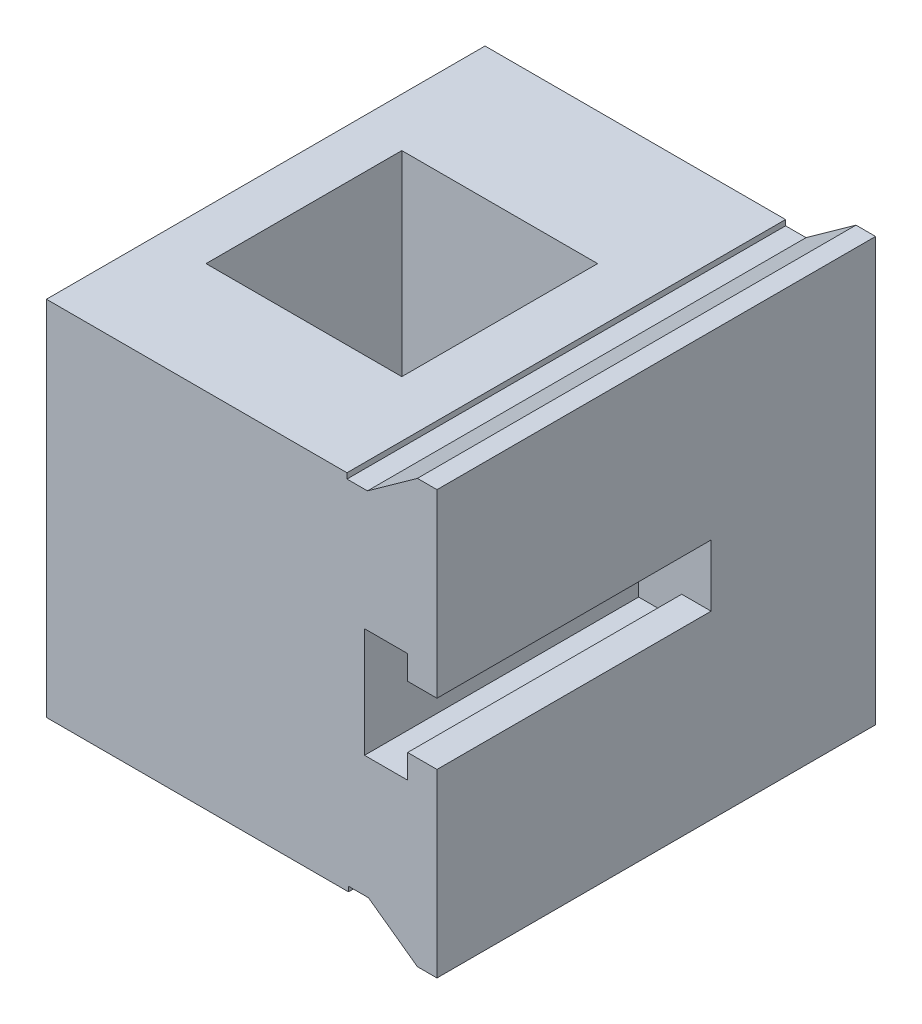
ISO-10303-21;
HEADER;
FILE_DESCRIPTION(('STEP AP214'),'2;1');
FILE_NAME('part.step','',(''),(''),'','','');
FILE_SCHEMA(('AUTOMOTIVE_DESIGN { 1 0 10303 214 1 1 1 1 }'));
ENDSEC;
DATA;
#1=APPLICATION_CONTEXT('core data for automotive mechanical design processes');
#2=APPLICATION_PROTOCOL_DEFINITION('international standard','automotive_design',2000,#1);
#3=PRODUCT_CONTEXT('',#1,'mechanical');
#4=PRODUCT('Part','Part','',(#3));
#5=PRODUCT_RELATED_PRODUCT_CATEGORY('part','',(#4));
#6=PRODUCT_DEFINITION_FORMATION('','',#4);
#7=PRODUCT_DEFINITION_CONTEXT('part definition',#1,'design');
#8=PRODUCT_DEFINITION('design','',#6,#7);
#9=PRODUCT_DEFINITION_SHAPE('','',#8);
#10=(LENGTH_UNIT() NAMED_UNIT(*) SI_UNIT(.MILLI.,.METRE.));
#11=(NAMED_UNIT(*) PLANE_ANGLE_UNIT() SI_UNIT($,.RADIAN.));
#12=(NAMED_UNIT(*) SI_UNIT($,.STERADIAN.) SOLID_ANGLE_UNIT());
#13=UNCERTAINTY_MEASURE_WITH_UNIT(LENGTH_MEASURE(1.E-05),#10,'distance_accuracy_value','');
#14=(GEOMETRIC_REPRESENTATION_CONTEXT(3) GLOBAL_UNCERTAINTY_ASSIGNED_CONTEXT((#13)) GLOBAL_UNIT_ASSIGNED_CONTEXT((#10,
#11,#12)) REPRESENTATION_CONTEXT('',''));
#15=CARTESIAN_POINT('',(0.,0.,0.));
#16=DIRECTION('',(0.,0.,1.));
#17=DIRECTION('',(1.,0.,0.));
#18=AXIS2_PLACEMENT_3D('',#15,#16,#17);
#19=CARTESIAN_POINT('',(-20.989332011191,2.24372854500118,0.));
#20=DIRECTION('',(-1.,0.,0.));
#21=DIRECTION('',(0.,0.,1.));
#22=AXIS2_PLACEMENT_3D('',#19,#20,#21);
#23=CYLINDRICAL_SURFACE('',#22,3.);
#24=CARTESIAN_POINT('',(-25.989332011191,2.24372854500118,0.));
#25=DIRECTION('',(-1.,0.,0.));
#26=DIRECTION('',(0.,0.,1.));
#27=AXIS2_PLACEMENT_3D('',#24,#25,#26);
#28=CIRCLE('',#27,3.);
#29=CARTESIAN_POINT('',(-25.989332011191,2.24372854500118,3.));
#30=VERTEX_POINT('',#29);
#31=EDGE_CURVE('E269',#30,#30,#28,.T.);
#32=ORIENTED_EDGE('',*,*,#31,.F.);
#33=EDGE_LOOP('',(#32));
#34=FACE_BOUND('',#33,.T.);
#35=CARTESIAN_POINT('',(-28.989332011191,2.24372854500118,0.));
#36=DIRECTION('',(-1.,0.,0.));
#37=DIRECTION('',(0.,0.,1.));
#38=AXIS2_PLACEMENT_3D('',#35,#36,#37);
#39=CIRCLE('',#38,3.);
#40=CARTESIAN_POINT('',(-28.989332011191,2.24372854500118,3.));
#41=VERTEX_POINT('',#40);
#42=EDGE_CURVE('E51',#41,#41,#39,.F.);
#43=ORIENTED_EDGE('',*,*,#42,.F.);
#44=EDGE_LOOP('',(#43));
#45=FACE_BOUND('',#44,.T.);
#46=ADVANCED_FACE('F47',(#34,#45),#23,.F.);
#47=CARTESIAN_POINT('',(-1.16941230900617E-13,-16.7583056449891,-23.));
#48=DIRECTION('',(0.,1.,0.));
#49=DIRECTION('',(-1.,0.,0.));
#50=AXIS2_PLACEMENT_3D('',#47,#48,#49);
#51=PLANE('',#50);
#52=DIRECTION('',(-1.,0.,0.));
#53=VECTOR('',#52,1.);
#54=CARTESIAN_POINT('',(-1.16941230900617E-13,-16.7583056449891,-9.5));
#55=LINE('',#54,#53);
#56=CARTESIAN_POINT('',(-5.98933201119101,-16.758305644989,-9.5));
#57=VERTEX_POINT('',#56);
#58=CARTESIAN_POINT('',(-25.989332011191,-16.7583056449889,-9.5));
#59=VERTEX_POINT('',#58);
#60=EDGE_CURVE('E277',#57,#59,#55,.T.);
#61=ORIENTED_EDGE('',*,*,#60,.T.);
#62=DIRECTION('',(0.,0.,1.));
#63=VECTOR('',#62,1.);
#64=CARTESIAN_POINT('',(-25.989332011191,-16.7583056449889,-23.));
#65=LINE('',#64,#63);
#66=CARTESIAN_POINT('',(-25.989332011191,-16.7583056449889,10.5));
#67=VERTEX_POINT('',#66);
#68=EDGE_CURVE('E281',#59,#67,#65,.T.);
#69=ORIENTED_EDGE('',*,*,#68,.T.);
#70=DIRECTION('',(1.,0.,0.));
#71=VECTOR('',#70,1.);
#72=CARTESIAN_POINT('',(-1.16941230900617E-13,-16.7583056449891,10.5));
#73=LINE('',#72,#71);
#74=CARTESIAN_POINT('',(-5.989332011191,-16.758305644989,10.5));
#75=VERTEX_POINT('',#74);
#76=EDGE_CURVE('E259',#67,#75,#73,.T.);
#77=ORIENTED_EDGE('',*,*,#76,.T.);
#78=DIRECTION('',(0.,0.,-1.));
#79=VECTOR('',#78,1.);
#80=CARTESIAN_POINT('',(-5.98933201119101,-16.758305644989,-23.));
#81=LINE('',#80,#79);
#82=EDGE_CURVE('E273',#75,#57,#81,.T.);
#83=ORIENTED_EDGE('',*,*,#82,.T.);
#84=EDGE_LOOP('',(#61,#69,#77,#83));
#85=FACE_BOUND('',#84,.T.);
#86=DIRECTION('',(0.,0.,1.));
#87=VECTOR('',#86,1.);
#88=CARTESIAN_POINT('',(-0.135433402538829,-16.758305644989,-23.));
#89=LINE('',#88,#87);
#90=CARTESIAN_POINT('',(-0.135433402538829,-16.758305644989,-23.));
#91=VERTEX_POINT('',#90);
#92=CARTESIAN_POINT('',(-0.135433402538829,-16.758305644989,21.8));
#93=VERTEX_POINT('',#92);
#94=EDGE_CURVE('E366',#91,#93,#89,.T.);
#95=ORIENTED_EDGE('',*,*,#94,.T.);
#96=DIRECTION('',(-1.,0.,0.));
#97=VECTOR('',#96,1.);
#98=CARTESIAN_POINT('',(-1.16941230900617E-13,-16.7583056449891,21.8));
#99=LINE('',#98,#97);
#100=CARTESIAN_POINT('',(-30.989332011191,-16.7583056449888,21.8));
#101=VERTEX_POINT('',#100);
#102=EDGE_CURVE('E285',#93,#101,#99,.T.);
#103=ORIENTED_EDGE('',*,*,#102,.T.);
#104=DIRECTION('',(0.,0.,1.));
#105=VECTOR('',#104,1.);
#106=CARTESIAN_POINT('',(-30.989332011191,-16.7583056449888,-23.));
#107=LINE('',#106,#105);
#108=CARTESIAN_POINT('',(-30.989332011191,-16.7583056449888,-23.));
#109=VERTEX_POINT('',#108);
#110=EDGE_CURVE('E367',#109,#101,#107,.T.);
#111=ORIENTED_EDGE('',*,*,#110,.F.);
#112=DIRECTION('',(-1.,0.,0.));
#113=VECTOR('',#112,1.);
#114=CARTESIAN_POINT('',(-1.16941230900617E-13,-16.7583056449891,-23.));
#115=LINE('',#114,#113);
#116=EDGE_CURVE('E329',#91,#109,#115,.T.);
#117=ORIENTED_EDGE('',*,*,#116,.F.);
#118=EDGE_LOOP('',(#95,#103,#111,#117));
#119=FACE_BOUND('',#118,.T.);
#120=ADVANCED_FACE('F49',(#85,#119),#51,.F.);
#121=CARTESIAN_POINT('',(-30.989332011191,0.,-23.));
#122=DIRECTION('',(-1.,0.,0.));
#123=DIRECTION('',(0.,0.,1.));
#124=AXIS2_PLACEMENT_3D('',#121,#122,#123);
#125=PLANE('',#124);
#126=CARTESIAN_POINT('',(-30.989332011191,2.24372854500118,0.));
#127=DIRECTION('',(-1.,0.,0.));
#128=DIRECTION('',(0.,0.,1.));
#129=AXIS2_PLACEMENT_3D('',#126,#127,#128);
#130=CIRCLE('',#129,6.5);
#131=CARTESIAN_POINT('',(-30.989332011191,2.24372854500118,6.5));
#132=VERTEX_POINT('',#131);
#133=EDGE_CURVE('E250',#132,#132,#130,.T.);
#134=ORIENTED_EDGE('',*,*,#133,.F.);
#135=EDGE_LOOP('',(#134));
#136=FACE_BOUND('',#135,.T.);
#137=ORIENTED_EDGE('',*,*,#110,.T.);
#138=DIRECTION('',(0.,-1.,0.));
#139=VECTOR('',#138,1.);
#140=CARTESIAN_POINT('',(-30.989332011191,0.,21.8));
#141=LINE('',#140,#139);
#142=CARTESIAN_POINT('',(-30.989332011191,20.241694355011,21.8));
#143=VERTEX_POINT('',#142);
#144=EDGE_CURVE('E325',#143,#101,#141,.T.);
#145=ORIENTED_EDGE('',*,*,#144,.F.);
#146=DIRECTION('',(0.,0.,1.));
#147=VECTOR('',#146,1.);
#148=CARTESIAN_POINT('',(-30.989332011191,20.241694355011,-23.));
#149=LINE('',#148,#147);
#150=CARTESIAN_POINT('',(-30.989332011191,20.241694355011,-23.));
#151=VERTEX_POINT('',#150);
#152=EDGE_CURVE('E371',#151,#143,#149,.T.);
#153=ORIENTED_EDGE('',*,*,#152,.F.);
#154=DIRECTION('',(0.,-1.,0.));
#155=VECTOR('',#154,1.);
#156=CARTESIAN_POINT('',(-30.989332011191,0.,-23.));
#157=LINE('',#156,#155);
#158=EDGE_CURVE('E362',#151,#109,#157,.T.);
#159=ORIENTED_EDGE('',*,*,#158,.T.);
#160=EDGE_LOOP('',(#137,#145,#153,#159));
#161=FACE_BOUND('',#160,.T.);
#162=ADVANCED_FACE('F426',(#136,#161),#125,.T.);
#163=CARTESIAN_POINT('',(0.,20.241694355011,-23.));
#164=DIRECTION('',(0.,1.,0.));
#165=DIRECTION('',(0.,0.,1.));
#166=AXIS2_PLACEMENT_3D('',#163,#164,#165);
#167=PLANE('',#166);
#168=DIRECTION('',(0.,0.,1.));
#169=VECTOR('',#168,1.);
#170=CARTESIAN_POINT('',(-25.989332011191,20.241694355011,-23.));
#171=LINE('',#170,#169);
#172=CARTESIAN_POINT('',(-25.989332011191,20.241694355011,-9.5));
#173=VERTEX_POINT('',#172);
#174=CARTESIAN_POINT('',(-25.989332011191,20.241694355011,10.5));
#175=VERTEX_POINT('',#174);
#176=EDGE_CURVE('E11',#173,#175,#171,.T.);
#177=ORIENTED_EDGE('',*,*,#176,.F.);
#178=DIRECTION('',(-1.,0.,0.));
#179=VECTOR('',#178,1.);
#180=CARTESIAN_POINT('',(0.,20.241694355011,-9.5));
#181=LINE('',#180,#179);
#182=CARTESIAN_POINT('',(-5.98933201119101,20.241694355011,-9.5));
#183=VERTEX_POINT('',#182);
#184=EDGE_CURVE('E57',#183,#173,#181,.T.);
#185=ORIENTED_EDGE('',*,*,#184,.F.);
#186=DIRECTION('',(0.,0.,-1.));
#187=VECTOR('',#186,1.);
#188=CARTESIAN_POINT('',(-5.98933201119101,20.241694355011,-23.));
#189=LINE('',#188,#187);
#190=CARTESIAN_POINT('',(-5.989332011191,20.241694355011,10.5));
#191=VERTEX_POINT('',#190);
#192=EDGE_CURVE('E406',#191,#183,#189,.T.);
#193=ORIENTED_EDGE('',*,*,#192,.F.);
#194=DIRECTION('',(1.,0.,0.));
#195=VECTOR('',#194,1.);
#196=CARTESIAN_POINT('',(0.,20.241694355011,10.5));
#197=LINE('',#196,#195);
#198=EDGE_CURVE('E370',#175,#191,#197,.T.);
#199=ORIENTED_EDGE('',*,*,#198,.F.);
#200=EDGE_LOOP('',(#177,#185,#193,#199));
#201=FACE_BOUND('',#200,.T.);
#202=ORIENTED_EDGE('',*,*,#152,.T.);
#203=DIRECTION('',(-1.,0.,0.));
#204=VECTOR('',#203,1.);
#205=CARTESIAN_POINT('',(0.,20.241694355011,21.8));
#206=LINE('',#205,#204);
#207=CARTESIAN_POINT('',(-0.290879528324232,20.241694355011,21.8));
#208=VERTEX_POINT('',#207);
#209=EDGE_CURVE('E321',#208,#143,#206,.T.);
#210=ORIENTED_EDGE('',*,*,#209,.F.);
#211=DIRECTION('',(0.,0.,1.));
#212=VECTOR('',#211,1.);
#213=CARTESIAN_POINT('',(-0.290879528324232,20.241694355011,-23.));
#214=LINE('',#213,#212);
#215=CARTESIAN_POINT('',(-0.290879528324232,20.241694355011,-23.));
#216=VERTEX_POINT('',#215);
#217=EDGE_CURVE('E374',#216,#208,#214,.T.);
#218=ORIENTED_EDGE('',*,*,#217,.F.);
#219=DIRECTION('',(-1.,0.,0.));
#220=VECTOR('',#219,1.);
#221=CARTESIAN_POINT('',(0.,20.241694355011,-23.));
#222=LINE('',#221,#220);
#223=EDGE_CURVE('E358',#216,#151,#222,.T.);
#224=ORIENTED_EDGE('',*,*,#223,.T.);
#225=EDGE_LOOP('',(#202,#210,#218,#224));
#226=FACE_BOUND('',#225,.T.);
#227=ADVANCED_FACE('F457',(#201,#226),#167,.T.);
#228=CARTESIAN_POINT('',(-0.205835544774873,-0.000864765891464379,-23.));
#229=DIRECTION('',(0.999991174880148,0.00420120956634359,0.));
#230=DIRECTION('',(-0.00420120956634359,0.999991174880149,0.));
#231=AXIS2_PLACEMENT_3D('',#228,#229,#230);
#232=PLANE('',#231);
#233=ORIENTED_EDGE('',*,*,#217,.T.);
#234=DIRECTION('',(-0.00420120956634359,0.999991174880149,0.));
#235=VECTOR('',#234,1.);
#236=CARTESIAN_POINT('',(-0.205835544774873,-0.000864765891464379,21.8));
#237=LINE('',#236,#235);
#238=CARTESIAN_POINT('',(-0.288534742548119,19.6835776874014,21.8));
#239=VERTEX_POINT('',#238);
#240=EDGE_CURVE('E294',#239,#208,#237,.T.);
#241=ORIENTED_EDGE('',*,*,#240,.F.);
#242=DIRECTION('',(0.,0.,1.));
#243=VECTOR('',#242,1.);
#244=CARTESIAN_POINT('',(-0.288534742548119,19.6835776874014,-23.));
#245=LINE('',#244,#243);
#246=CARTESIAN_POINT('',(-0.288534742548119,19.6835776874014,-23.));
#247=VERTEX_POINT('',#246);
#248=EDGE_CURVE('E377',#247,#239,#245,.T.);
#249=ORIENTED_EDGE('',*,*,#248,.F.);
#250=DIRECTION('',(-0.00420120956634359,0.999991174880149,0.));
#251=VECTOR('',#250,1.);
#252=CARTESIAN_POINT('',(-0.205835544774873,-0.000864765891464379,-23.));
#253=LINE('',#252,#251);
#254=EDGE_CURVE('E337',#247,#216,#253,.T.);
#255=ORIENTED_EDGE('',*,*,#254,.T.);
#256=EDGE_LOOP('',(#233,#241,#249,#255));
#257=FACE_BOUND('',#256,.T.);
#258=ADVANCED_FACE('F461',(#257),#232,.T.);
#259=CARTESIAN_POINT('',(0.,19.6835776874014,-23.));
#260=DIRECTION('',(0.,-1.,0.));
#261=DIRECTION('',(1.,0.,0.));
#262=AXIS2_PLACEMENT_3D('',#259,#260,#261);
#263=PLANE('',#262);
#264=ORIENTED_EDGE('',*,*,#248,.T.);
#265=DIRECTION('',(1.,0.,0.));
#266=VECTOR('',#265,1.);
#267=CARTESIAN_POINT('',(0.,19.6835776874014,21.8));
#268=LINE('',#267,#266);
#269=CARTESIAN_POINT('',(1.80132440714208,19.6835776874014,21.8));
#270=VERTEX_POINT('',#269);
#271=EDGE_CURVE('E317',#239,#270,#268,.T.);
#272=ORIENTED_EDGE('',*,*,#271,.T.);
#273=DIRECTION('',(0.,0.,1.));
#274=VECTOR('',#273,1.);
#275=CARTESIAN_POINT('',(1.80132440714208,19.6835776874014,-23.));
#276=LINE('',#275,#274);
#277=CARTESIAN_POINT('',(1.80132440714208,19.6835776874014,-23.));
#278=VERTEX_POINT('',#277);
#279=EDGE_CURVE('E380',#278,#270,#276,.T.);
#280=ORIENTED_EDGE('',*,*,#279,.F.);
#281=DIRECTION('',(1.,0.,0.));
#282=VECTOR('',#281,1.);
#283=CARTESIAN_POINT('',(0.,19.6835776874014,-23.));
#284=LINE('',#283,#282);
#285=EDGE_CURVE('E355',#247,#278,#284,.T.);
#286=ORIENTED_EDGE('',*,*,#285,.F.);
#287=EDGE_LOOP('',(#264,#272,#280,#286));
#288=FACE_BOUND('',#287,.T.);
#289=ADVANCED_FACE('F465',(#288),#263,.F.);
#290=CARTESIAN_POINT('',(-8.7097527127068,12.1465502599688,-23.));
#291=DIRECTION('',(0.582727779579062,-0.812667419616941,0.));
#292=DIRECTION('',(0.812667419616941,0.582727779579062,0.));
#293=AXIS2_PLACEMENT_3D('',#290,#291,#292);
#294=PLANE('',#293);
#295=ORIENTED_EDGE('',*,*,#279,.T.);
#296=DIRECTION('',(0.812667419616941,0.582727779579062,0.));
#297=VECTOR('',#296,1.);
#298=CARTESIAN_POINT('',(-8.7097527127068,12.1465502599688,21.8));
#299=LINE('',#298,#297);
#300=CARTESIAN_POINT('',(6.9029046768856,23.3416947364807,21.8));
#301=VERTEX_POINT('',#300);
#302=EDGE_CURVE('E313',#270,#301,#299,.T.);
#303=ORIENTED_EDGE('',*,*,#302,.T.);
#304=DIRECTION('',(0.,0.,1.));
#305=VECTOR('',#304,1.);
#306=CARTESIAN_POINT('',(6.9029046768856,23.3416947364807,-23.));
#307=LINE('',#306,#305);
#308=CARTESIAN_POINT('',(6.9029046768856,23.3416947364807,-23.));
#309=VERTEX_POINT('',#308);
#310=EDGE_CURVE('E383',#309,#301,#307,.T.);
#311=ORIENTED_EDGE('',*,*,#310,.F.);
#312=DIRECTION('',(0.812667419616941,0.582727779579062,0.));
#313=VECTOR('',#312,1.);
#314=CARTESIAN_POINT('',(-8.7097527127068,12.1465502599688,-23.));
#315=LINE('',#314,#313);
#316=EDGE_CURVE('E352',#278,#309,#315,.T.);
#317=ORIENTED_EDGE('',*,*,#316,.F.);
#318=EDGE_LOOP('',(#295,#303,#311,#317));
#319=FACE_BOUND('',#318,.T.);
#320=ADVANCED_FACE('F469',(#319),#294,.F.);
#321=CARTESIAN_POINT('',(0.,23.3416947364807,-23.));
#322=DIRECTION('',(0.,-1.,0.));
#323=DIRECTION('',(0.,0.,-1.));
#324=AXIS2_PLACEMENT_3D('',#321,#322,#323);
#325=PLANE('',#324);
#326=ORIENTED_EDGE('',*,*,#310,.T.);
#327=DIRECTION('',(1.,0.,0.));
#328=VECTOR('',#327,1.);
#329=CARTESIAN_POINT('',(0.,23.3416947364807,21.8));
#330=LINE('',#329,#328);
#331=CARTESIAN_POINT('',(8.90290515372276,23.3416947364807,21.8));
#332=VERTEX_POINT('',#331);
#333=EDGE_CURVE('E309',#301,#332,#330,.T.);
#334=ORIENTED_EDGE('',*,*,#333,.T.);
#335=DIRECTION('',(0.,0.,1.));
#336=VECTOR('',#335,1.);
#337=CARTESIAN_POINT('',(8.90290515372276,23.3416947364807,-23.));
#338=LINE('',#337,#336);
#339=CARTESIAN_POINT('',(8.90290515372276,23.3416947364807,-23.));
#340=VERTEX_POINT('',#339);
#341=EDGE_CURVE('E386',#340,#332,#338,.T.);
#342=ORIENTED_EDGE('',*,*,#341,.F.);
#343=DIRECTION('',(1.,0.,0.));
#344=VECTOR('',#343,1.);
#345=CARTESIAN_POINT('',(0.,23.3416947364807,-23.));
#346=LINE('',#345,#344);
#347=EDGE_CURVE('E349',#309,#340,#346,.T.);
#348=ORIENTED_EDGE('',*,*,#347,.F.);
#349=EDGE_LOOP('',(#326,#334,#342,#348));
#350=FACE_BOUND('',#349,.T.);
#351=ADVANCED_FACE('F473',(#350),#325,.F.);
#352=CARTESIAN_POINT('',(8.90290515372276,0.,-23.));
#353=DIRECTION('',(-1.,0.,0.));
#354=DIRECTION('',(0.,0.,1.));
#355=AXIS2_PLACEMENT_3D('',#352,#353,#354);
#356=PLANE('',#355);
#357=DIRECTION('',(0.,1.,0.));
#358=VECTOR('',#357,1.);
#359=CARTESIAN_POINT('',(8.90290515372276,4.89169435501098,-6.2));
#360=LINE('',#359,#358);
#361=CARTESIAN_POINT('',(8.90290515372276,-1.40830564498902,-6.2));
#362=VERTEX_POINT('',#361);
#363=CARTESIAN_POINT('',(8.90290515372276,4.89169435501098,-6.2));
#364=VERTEX_POINT('',#363);
#365=EDGE_CURVE('E219',#362,#364,#360,.T.);
#366=ORIENTED_EDGE('',*,*,#365,.F.);
#367=DIRECTION('',(0.,0.,1.));
#368=VECTOR('',#367,1.);
#369=CARTESIAN_POINT('',(8.90290515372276,-1.40830564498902,-6.2));
#370=LINE('',#369,#368);
#371=CARTESIAN_POINT('',(8.90290515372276,-1.40830564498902,21.8));
#372=VERTEX_POINT('',#371);
#373=EDGE_CURVE('E254',#362,#372,#370,.T.);
#374=ORIENTED_EDGE('',*,*,#373,.T.);
#375=DIRECTION('',(0.,-1.,0.));
#376=VECTOR('',#375,1.);
#377=CARTESIAN_POINT('',(8.90290515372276,0.,21.8));
#378=LINE('',#377,#376);
#379=CARTESIAN_POINT('',(8.90290515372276,-19.8583060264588,21.8));
#380=VERTEX_POINT('',#379);
#381=EDGE_CURVE('E306',#372,#380,#378,.T.);
#382=ORIENTED_EDGE('',*,*,#381,.T.);
#383=DIRECTION('',(0.,0.,1.));
#384=VECTOR('',#383,1.);
#385=CARTESIAN_POINT('',(8.90290515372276,-19.8583060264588,-23.));
#386=LINE('',#385,#384);
#387=CARTESIAN_POINT('',(8.90290515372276,-19.8583060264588,-23.));
#388=VERTEX_POINT('',#387);
#389=EDGE_CURVE('E389',#388,#380,#386,.T.);
#390=ORIENTED_EDGE('',*,*,#389,.F.);
#391=DIRECTION('',(0.,-1.,0.));
#392=VECTOR('',#391,1.);
#393=CARTESIAN_POINT('',(8.90290515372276,0.,-23.));
#394=LINE('',#393,#392);
#395=EDGE_CURVE('E346',#340,#388,#394,.T.);
#396=ORIENTED_EDGE('',*,*,#395,.F.);
#397=ORIENTED_EDGE('',*,*,#341,.T.);
#398=CARTESIAN_POINT('',(8.90290515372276,4.89169435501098,21.8));
#399=VERTEX_POINT('',#398);
#400=EDGE_CURVE('E235',#332,#399,#378,.T.);
#401=ORIENTED_EDGE('',*,*,#400,.T.);
#402=DIRECTION('',(0.,0.,1.));
#403=VECTOR('',#402,1.);
#404=CARTESIAN_POINT('',(8.90290515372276,4.89169435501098,-6.2));
#405=LINE('',#404,#403);
#406=EDGE_CURVE('E65',#364,#399,#405,.T.);
#407=ORIENTED_EDGE('',*,*,#406,.F.);
#408=EDGE_LOOP('',(#366,#374,#382,#390,#396,#397,#401,#407));
#409=FACE_BOUND('',#408,.T.);
#410=ADVANCED_FACE('F233',(#409),#356,.F.);
#411=CARTESIAN_POINT('',(0.,-19.8583060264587,-23.));
#412=DIRECTION('',(0.,1.,0.));
#413=DIRECTION('',(-1.,0.,0.));
#414=AXIS2_PLACEMENT_3D('',#411,#412,#413);
#415=PLANE('',#414);
#416=ORIENTED_EDGE('',*,*,#389,.T.);
#417=DIRECTION('',(-1.,0.,0.));
#418=VECTOR('',#417,1.);
#419=CARTESIAN_POINT('',(0.,-19.8583060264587,21.8));
#420=LINE('',#419,#418);
#421=CARTESIAN_POINT('',(6.9029046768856,-19.8583060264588,21.8));
#422=VERTEX_POINT('',#421);
#423=EDGE_CURVE('E302',#380,#422,#420,.T.);
#424=ORIENTED_EDGE('',*,*,#423,.T.);
#425=DIRECTION('',(0.,0.,1.));
#426=VECTOR('',#425,1.);
#427=CARTESIAN_POINT('',(6.9029046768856,-19.8583060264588,-23.));
#428=LINE('',#427,#426);
#429=CARTESIAN_POINT('',(6.9029046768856,-19.8583060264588,-23.));
#430=VERTEX_POINT('',#429);
#431=EDGE_CURVE('E393',#430,#422,#428,.T.);
#432=ORIENTED_EDGE('',*,*,#431,.F.);
#433=DIRECTION('',(-1.,0.,0.));
#434=VECTOR('',#433,1.);
#435=CARTESIAN_POINT('',(0.,-19.8583060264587,-23.));
#436=LINE('',#435,#434);
#437=EDGE_CURVE('E343',#388,#430,#436,.T.);
#438=ORIENTED_EDGE('',*,*,#437,.F.);
#439=EDGE_LOOP('',(#416,#424,#432,#438));
#440=FACE_BOUND('',#439,.T.);
#441=ADVANCED_FACE('F480',(#440),#415,.F.);
#442=CARTESIAN_POINT('',(-7.05974351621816,-9.80519935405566,-23.));
#443=DIRECTION('',(0.584304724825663,0.811534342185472,0.));
#444=DIRECTION('',(-0.811534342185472,0.584304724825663,0.));
#445=AXIS2_PLACEMENT_3D('',#442,#443,#444);
#446=PLANE('',#445);
#447=ORIENTED_EDGE('',*,*,#431,.T.);
#448=DIRECTION('',(-0.811534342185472,0.584304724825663,0.));
#449=VECTOR('',#448,1.);
#450=CARTESIAN_POINT('',(-7.05974351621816,-9.80519935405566,21.8));
#451=LINE('',#450,#449);
#452=CARTESIAN_POINT('',(1.90290479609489,-16.2583061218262,21.8));
#453=VERTEX_POINT('',#452);
#454=EDGE_CURVE('E298',#422,#453,#451,.T.);
#455=ORIENTED_EDGE('',*,*,#454,.T.);
#456=DIRECTION('',(0.,0.,1.));
#457=VECTOR('',#456,1.);
#458=CARTESIAN_POINT('',(1.90290479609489,-16.2583061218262,-23.));
#459=LINE('',#458,#457);
#460=CARTESIAN_POINT('',(1.90290479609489,-16.2583061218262,-23.));
#461=VERTEX_POINT('',#460);
#462=EDGE_CURVE('E396',#461,#453,#459,.T.);
#463=ORIENTED_EDGE('',*,*,#462,.F.);
#464=DIRECTION('',(-0.811534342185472,0.584304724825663,0.));
#465=VECTOR('',#464,1.);
#466=CARTESIAN_POINT('',(-7.05974351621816,-9.80519935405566,-23.));
#467=LINE('',#466,#465);
#468=EDGE_CURVE('E340',#430,#461,#467,.T.);
#469=ORIENTED_EDGE('',*,*,#468,.F.);
#470=EDGE_LOOP('',(#447,#455,#463,#469));
#471=FACE_BOUND('',#470,.T.);
#472=ADVANCED_FACE('F483',(#471),#446,.F.);
#473=CARTESIAN_POINT('',(0.,-16.2583061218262,-23.));
#474=DIRECTION('',(0.,1.,0.));
#475=DIRECTION('',(0.,0.,1.));
#476=AXIS2_PLACEMENT_3D('',#473,#474,#475);
#477=PLANE('',#476);
#478=ORIENTED_EDGE('',*,*,#462,.T.);
#479=DIRECTION('',(-1.,0.,0.));
#480=VECTOR('',#479,1.);
#481=CARTESIAN_POINT('',(0.,-16.2583061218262,21.8));
#482=LINE('',#481,#480);
#483=CARTESIAN_POINT('',(-0.137534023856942,-16.2583061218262,21.8));
#484=VERTEX_POINT('',#483);
#485=EDGE_CURVE('E293',#453,#484,#482,.T.);
#486=ORIENTED_EDGE('',*,*,#485,.T.);
#487=DIRECTION('',(0.,0.,1.));
#488=VECTOR('',#487,1.);
#489=CARTESIAN_POINT('',(-0.137534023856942,-16.2583061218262,-23.));
#490=LINE('',#489,#488);
#491=CARTESIAN_POINT('',(-0.137534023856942,-16.2583061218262,-23.));
#492=VERTEX_POINT('',#491);
#493=EDGE_CURVE('E399',#492,#484,#490,.T.);
#494=ORIENTED_EDGE('',*,*,#493,.F.);
#495=DIRECTION('',(-1.,0.,0.));
#496=VECTOR('',#495,1.);
#497=CARTESIAN_POINT('',(0.,-16.2583061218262,-23.));
#498=LINE('',#497,#496);
#499=EDGE_CURVE('E336',#461,#492,#498,.T.);
#500=ORIENTED_EDGE('',*,*,#499,.F.);
#501=EDGE_LOOP('',(#478,#486,#494,#500));
#502=FACE_BOUND('',#501,.T.);
#503=ADVANCED_FACE('F486',(#502),#477,.F.);
#504=ORIENTED_EDGE('',*,*,#493,.T.);
#505=EDGE_CURVE('E289',#93,#484,#237,.T.);
#506=ORIENTED_EDGE('',*,*,#505,.F.);
#507=ORIENTED_EDGE('',*,*,#94,.F.);
#508=EDGE_CURVE('E332',#91,#492,#253,.T.);
#509=ORIENTED_EDGE('',*,*,#508,.T.);
#510=EDGE_LOOP('',(#504,#506,#507,#509));
#511=FACE_BOUND('',#510,.T.);
#512=ADVANCED_FACE('F453',(#511),#232,.T.);
#513=CARTESIAN_POINT('',(0.,0.,-23.));
#514=DIRECTION('',(0.,0.,1.));
#515=DIRECTION('',(1.,0.,0.));
#516=AXIS2_PLACEMENT_3D('',#513,#514,#515);
#517=PLANE('',#516);
#518=ORIENTED_EDGE('',*,*,#116,.T.);
#519=ORIENTED_EDGE('',*,*,#158,.F.);
#520=ORIENTED_EDGE('',*,*,#223,.F.);
#521=ORIENTED_EDGE('',*,*,#254,.F.);
#522=ORIENTED_EDGE('',*,*,#285,.T.);
#523=ORIENTED_EDGE('',*,*,#316,.T.);
#524=ORIENTED_EDGE('',*,*,#347,.T.);
#525=ORIENTED_EDGE('',*,*,#395,.T.);
#526=ORIENTED_EDGE('',*,*,#437,.T.);
#527=ORIENTED_EDGE('',*,*,#468,.T.);
#528=ORIENTED_EDGE('',*,*,#499,.T.);
#529=ORIENTED_EDGE('',*,*,#508,.F.);
#530=EDGE_LOOP('',(#518,#519,#520,#521,#522,#523,#524,#525,#526,#527,#528,#529));
#531=FACE_BOUND('',#530,.T.);
#532=ADVANCED_FACE('F449',(#531),#517,.F.);
#533=CARTESIAN_POINT('',(0.,0.,21.8));
#534=DIRECTION('',(0.,0.,1.));
#535=DIRECTION('',(1.,0.,0.));
#536=AXIS2_PLACEMENT_3D('',#533,#534,#535);
#537=PLANE('',#536);
#538=DIRECTION('',(1.,0.,0.));
#539=VECTOR('',#538,1.);
#540=CARTESIAN_POINT('',(8.90290515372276,-1.40830564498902,21.8));
#541=LINE('',#540,#539);
#542=CARTESIAN_POINT('',(5.90290515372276,-1.40830564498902,21.8));
#543=VERTEX_POINT('',#542);
#544=EDGE_CURVE('E230',#543,#372,#541,.T.);
#545=ORIENTED_EDGE('',*,*,#544,.F.);
#546=DIRECTION('',(0.,1.,0.));
#547=VECTOR('',#546,1.);
#548=CARTESIAN_POINT('',(5.90290515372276,-1.40830564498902,21.8));
#549=LINE('',#548,#547);
#550=CARTESIAN_POINT('',(5.90290515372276,-3.85830564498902,21.8));
#551=VERTEX_POINT('',#550);
#552=EDGE_CURVE('E559',#551,#543,#549,.T.);
#553=ORIENTED_EDGE('',*,*,#552,.F.);
#554=DIRECTION('',(1.,0.,0.));
#555=VECTOR('',#554,1.);
#556=CARTESIAN_POINT('',(5.90290515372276,-3.85830564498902,21.8));
#557=LINE('',#556,#555);
#558=CARTESIAN_POINT('',(1.50290515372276,-3.85830564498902,21.8));
#559=VERTEX_POINT('',#558);
#560=EDGE_CURVE('E555',#559,#551,#557,.T.);
#561=ORIENTED_EDGE('',*,*,#560,.F.);
#562=DIRECTION('',(0.,-1.,0.));
#563=VECTOR('',#562,1.);
#564=CARTESIAN_POINT('',(1.50290515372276,-3.85830564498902,21.8));
#565=LINE('',#564,#563);
#566=CARTESIAN_POINT('',(1.50290515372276,7.34169435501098,21.8));
#567=VERTEX_POINT('',#566);
#568=EDGE_CURVE('E551',#567,#559,#565,.T.);
#569=ORIENTED_EDGE('',*,*,#568,.F.);
#570=DIRECTION('',(-1.,0.,0.));
#571=VECTOR('',#570,1.);
#572=CARTESIAN_POINT('',(1.50290515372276,7.34169435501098,21.8));
#573=LINE('',#572,#571);
#574=CARTESIAN_POINT('',(5.90290515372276,7.34169435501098,21.8));
#575=VERTEX_POINT('',#574);
#576=EDGE_CURVE('E544',#575,#567,#573,.T.);
#577=ORIENTED_EDGE('',*,*,#576,.F.);
#578=DIRECTION('',(0.,1.,0.));
#579=VECTOR('',#578,1.);
#580=CARTESIAN_POINT('',(5.90290515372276,7.34169435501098,21.8));
#581=LINE('',#580,#579);
#582=CARTESIAN_POINT('',(5.90290515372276,4.89169435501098,21.8));
#583=VERTEX_POINT('',#582);
#584=EDGE_CURVE('E540',#583,#575,#581,.T.);
#585=ORIENTED_EDGE('',*,*,#584,.F.);
#586=DIRECTION('',(-1.,0.,0.));
#587=VECTOR('',#586,1.);
#588=CARTESIAN_POINT('',(5.90290515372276,4.89169435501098,21.8));
#589=LINE('',#588,#587);
#590=EDGE_CURVE('E535',#399,#583,#589,.T.);
#591=ORIENTED_EDGE('',*,*,#590,.F.);
#592=ORIENTED_EDGE('',*,*,#400,.F.);
#593=ORIENTED_EDGE('',*,*,#333,.F.);
#594=ORIENTED_EDGE('',*,*,#302,.F.);
#595=ORIENTED_EDGE('',*,*,#271,.F.);
#596=ORIENTED_EDGE('',*,*,#240,.T.);
#597=ORIENTED_EDGE('',*,*,#209,.T.);
#598=ORIENTED_EDGE('',*,*,#144,.T.);
#599=ORIENTED_EDGE('',*,*,#102,.F.);
#600=ORIENTED_EDGE('',*,*,#505,.T.);
#601=ORIENTED_EDGE('',*,*,#485,.F.);
#602=ORIENTED_EDGE('',*,*,#454,.F.);
#603=ORIENTED_EDGE('',*,*,#423,.F.);
#604=ORIENTED_EDGE('',*,*,#381,.F.);
#605=EDGE_LOOP('',(#545,#553,#561,#569,#577,#585,#591,#592,#593,#594,#595,#596,#597,#598,#599,
#600,#601,#602,#603,#604));
#606=FACE_BOUND('',#605,.T.);
#607=ADVANCED_FACE('F446',(#606),#537,.T.);
#608=CARTESIAN_POINT('',(-25.989332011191,-19.8583060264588,-9.5));
#609=DIRECTION('',(-1.,0.,0.));
#610=DIRECTION('',(0.,0.,1.));
#611=AXIS2_PLACEMENT_3D('',#608,#609,#610);
#612=PLANE('',#611);
#613=ORIENTED_EDGE('',*,*,#31,.T.);
#614=EDGE_LOOP('',(#613));
#615=FACE_BOUND('',#614,.T.);
#616=DIRECTION('',(0.,1.,0.));
#617=VECTOR('',#616,1.);
#618=CARTESIAN_POINT('',(-25.989332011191,-19.8583060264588,-9.5));
#619=LINE('',#618,#617);
#620=EDGE_CURVE('E255',#59,#173,#619,.T.);
#621=ORIENTED_EDGE('',*,*,#620,.T.);
#622=ORIENTED_EDGE('',*,*,#176,.T.);
#623=DIRECTION('',(0.,1.,0.));
#624=VECTOR('',#623,1.);
#625=CARTESIAN_POINT('',(-25.989332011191,-19.8583060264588,10.5));
#626=LINE('',#625,#624);
#627=EDGE_CURVE('E266',#67,#175,#626,.T.);
#628=ORIENTED_EDGE('',*,*,#627,.F.);
#629=ORIENTED_EDGE('',*,*,#68,.F.);
#630=EDGE_LOOP('',(#621,#622,#628,#629));
#631=FACE_BOUND('',#630,.T.);
#632=ADVANCED_FACE('F436',(#615,#631),#612,.F.);
#633=CARTESIAN_POINT('',(-25.989332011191,-19.8583060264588,-9.5));
#634=DIRECTION('',(0.,0.,-1.));
#635=DIRECTION('',(-1.,0.,0.));
#636=AXIS2_PLACEMENT_3D('',#633,#634,#635);
#637=PLANE('',#636);
#638=DIRECTION('',(0.,1.,0.));
#639=VECTOR('',#638,1.);
#640=CARTESIAN_POINT('',(-5.98933201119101,-19.8583060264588,-9.5));
#641=LINE('',#640,#639);
#642=EDGE_CURVE('E260',#57,#183,#641,.T.);
#643=ORIENTED_EDGE('',*,*,#642,.T.);
#644=ORIENTED_EDGE('',*,*,#184,.T.);
#645=ORIENTED_EDGE('',*,*,#620,.F.);
#646=ORIENTED_EDGE('',*,*,#60,.F.);
#647=EDGE_LOOP('',(#643,#644,#645,#646));
#648=FACE_BOUND('',#647,.T.);
#649=ADVANCED_FACE('F432',(#648),#637,.F.);
#650=CARTESIAN_POINT('',(-5.98933201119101,-19.8583060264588,-9.5));
#651=DIRECTION('',(1.,0.,0.));
#652=DIRECTION('',(0.,0.,-1.));
#653=AXIS2_PLACEMENT_3D('',#650,#651,#652);
#654=PLANE('',#653);
#655=DIRECTION('',(0.,1.,0.));
#656=VECTOR('',#655,1.);
#657=CARTESIAN_POINT('',(-5.989332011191,-19.8583060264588,10.5));
#658=LINE('',#657,#656);
#659=EDGE_CURVE('E73',#75,#191,#658,.T.);
#660=ORIENTED_EDGE('',*,*,#659,.T.);
#661=ORIENTED_EDGE('',*,*,#192,.T.);
#662=ORIENTED_EDGE('',*,*,#642,.F.);
#663=ORIENTED_EDGE('',*,*,#82,.F.);
#664=EDGE_LOOP('',(#660,#661,#662,#663));
#665=FACE_BOUND('',#664,.T.);
#666=ADVANCED_FACE('F435',(#665),#654,.F.);
#667=CARTESIAN_POINT('',(-25.989332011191,-19.8583060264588,10.5));
#668=DIRECTION('',(0.,0.,1.));
#669=DIRECTION('',(1.,0.,0.));
#670=AXIS2_PLACEMENT_3D('',#667,#668,#669);
#671=PLANE('',#670);
#672=ORIENTED_EDGE('',*,*,#627,.T.);
#673=ORIENTED_EDGE('',*,*,#198,.T.);
#674=ORIENTED_EDGE('',*,*,#659,.F.);
#675=ORIENTED_EDGE('',*,*,#76,.F.);
#676=EDGE_LOOP('',(#672,#673,#674,#675));
#677=FACE_BOUND('',#676,.T.);
#678=ADVANCED_FACE('F440',(#677),#671,.F.);
#679=CARTESIAN_POINT('',(-28.989332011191,2.24372854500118,0.));
#680=DIRECTION('',(-1.,0.,0.));
#681=DIRECTION('',(0.,0.,1.));
#682=AXIS2_PLACEMENT_3D('',#679,#680,#681);
#683=PLANE('',#682);
#684=CARTESIAN_POINT('',(-28.989332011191,2.24372854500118,0.));
#685=DIRECTION('',(-1.,0.,0.));
#686=DIRECTION('',(0.,0.,1.));
#687=AXIS2_PLACEMENT_3D('',#684,#685,#686);
#688=CIRCLE('',#687,6.5);
#689=CARTESIAN_POINT('',(-28.989332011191,2.24372854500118,6.5));
#690=VERTEX_POINT('',#689);
#691=EDGE_CURVE('E246',#690,#690,#688,.T.);
#692=ORIENTED_EDGE('',*,*,#691,.T.);
#693=EDGE_LOOP('',(#692));
#694=FACE_BOUND('',#693,.T.);
#695=ORIENTED_EDGE('',*,*,#42,.T.);
#696=EDGE_LOOP('',(#695));
#697=FACE_BOUND('',#696,.T.);
#698=ADVANCED_FACE('F418',(#694,#697),#683,.T.);
#699=CARTESIAN_POINT('',(-28.989332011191,2.24372854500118,0.));
#700=DIRECTION('',(-1.,0.,0.));
#701=DIRECTION('',(0.,0.,1.));
#702=AXIS2_PLACEMENT_3D('',#699,#700,#701);
#703=CYLINDRICAL_SURFACE('',#702,6.5);
#704=ORIENTED_EDGE('',*,*,#691,.F.);
#705=EDGE_LOOP('',(#704));
#706=FACE_BOUND('',#705,.T.);
#707=ORIENTED_EDGE('',*,*,#133,.T.);
#708=EDGE_LOOP('',(#707));
#709=FACE_BOUND('',#708,.T.);
#710=ADVANCED_FACE('F430',(#706,#709),#703,.F.);
#711=CARTESIAN_POINT('',(8.90290515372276,-1.40830564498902,-6.2));
#712=DIRECTION('',(0.,-1.,0.));
#713=DIRECTION('',(0.,0.,-1.));
#714=AXIS2_PLACEMENT_3D('',#711,#712,#713);
#715=PLANE('',#714);
#716=ORIENTED_EDGE('',*,*,#544,.T.);
#717=ORIENTED_EDGE('',*,*,#373,.F.);
#718=DIRECTION('',(1.,0.,0.));
#719=VECTOR('',#718,1.);
#720=CARTESIAN_POINT('',(8.90290515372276,-1.40830564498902,-6.2));
#721=LINE('',#720,#719);
#722=CARTESIAN_POINT('',(5.90290515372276,-1.40830564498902,-6.2));
#723=VERTEX_POINT('',#722);
#724=EDGE_CURVE('E226',#723,#362,#721,.T.);
#725=ORIENTED_EDGE('',*,*,#724,.F.);
#726=DIRECTION('',(0.,0.,1.));
#727=VECTOR('',#726,1.);
#728=CARTESIAN_POINT('',(5.90290515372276,-1.40830564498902,-6.2));
#729=LINE('',#728,#727);
#730=EDGE_CURVE('E567',#723,#543,#729,.T.);
#731=ORIENTED_EDGE('',*,*,#730,.T.);
#732=EDGE_LOOP('',(#716,#717,#725,#731));
#733=FACE_BOUND('',#732,.T.);
#734=ADVANCED_FACE('F608',(#733),#715,.F.);
#735=CARTESIAN_POINT('',(5.90290515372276,-1.40830564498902,-6.2));
#736=DIRECTION('',(1.,0.,0.));
#737=DIRECTION('',(0.,1.,0.));
#738=AXIS2_PLACEMENT_3D('',#735,#736,#737);
#739=PLANE('',#738);
#740=ORIENTED_EDGE('',*,*,#552,.T.);
#741=ORIENTED_EDGE('',*,*,#730,.F.);
#742=DIRECTION('',(0.,1.,0.));
#743=VECTOR('',#742,1.);
#744=CARTESIAN_POINT('',(5.90290515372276,-1.40830564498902,-6.2));
#745=LINE('',#744,#743);
#746=CARTESIAN_POINT('',(5.90290515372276,-3.85830564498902,-6.2));
#747=VERTEX_POINT('',#746);
#748=EDGE_CURVE('E242',#747,#723,#745,.T.);
#749=ORIENTED_EDGE('',*,*,#748,.F.);
#750=DIRECTION('',(0.,0.,1.));
#751=VECTOR('',#750,1.);
#752=CARTESIAN_POINT('',(5.90290515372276,-3.85830564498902,-6.2));
#753=LINE('',#752,#751);
#754=EDGE_CURVE('E570',#747,#551,#753,.T.);
#755=ORIENTED_EDGE('',*,*,#754,.T.);
#756=EDGE_LOOP('',(#740,#741,#749,#755));
#757=FACE_BOUND('',#756,.T.);
#758=ADVANCED_FACE('F609',(#757),#739,.F.);
#759=CARTESIAN_POINT('',(5.90290515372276,-3.85830564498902,-6.2));
#760=DIRECTION('',(0.,-1.,0.));
#761=DIRECTION('',(1.,0.,0.));
#762=AXIS2_PLACEMENT_3D('',#759,#760,#761);
#763=PLANE('',#762);
#764=ORIENTED_EDGE('',*,*,#560,.T.);
#765=ORIENTED_EDGE('',*,*,#754,.F.);
#766=DIRECTION('',(1.,0.,0.));
#767=VECTOR('',#766,1.);
#768=CARTESIAN_POINT('',(5.90290515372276,-3.85830564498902,-6.2));
#769=LINE('',#768,#767);
#770=CARTESIAN_POINT('',(1.50290515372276,-3.85830564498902,-6.2));
#771=VERTEX_POINT('',#770);
#772=EDGE_CURVE('E596',#771,#747,#769,.T.);
#773=ORIENTED_EDGE('',*,*,#772,.F.);
#774=DIRECTION('',(0.,0.,1.));
#775=VECTOR('',#774,1.);
#776=CARTESIAN_POINT('',(1.50290515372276,-3.85830564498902,-6.2));
#777=LINE('',#776,#775);
#778=EDGE_CURVE('E573',#771,#559,#777,.T.);
#779=ORIENTED_EDGE('',*,*,#778,.T.);
#780=EDGE_LOOP('',(#764,#765,#773,#779));
#781=FACE_BOUND('',#780,.T.);
#782=ADVANCED_FACE('F611',(#781),#763,.F.);
#783=CARTESIAN_POINT('',(1.50290515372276,-3.85830564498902,-6.2));
#784=DIRECTION('',(-1.,0.,0.));
#785=DIRECTION('',(0.,-1.,0.));
#786=AXIS2_PLACEMENT_3D('',#783,#784,#785);
#787=PLANE('',#786);
#788=ORIENTED_EDGE('',*,*,#568,.T.);
#789=ORIENTED_EDGE('',*,*,#778,.F.);
#790=DIRECTION('',(0.,-1.,0.));
#791=VECTOR('',#790,1.);
#792=CARTESIAN_POINT('',(1.50290515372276,-3.85830564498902,-6.2));
#793=LINE('',#792,#791);
#794=CARTESIAN_POINT('',(1.50290515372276,7.34169435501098,-6.2));
#795=VERTEX_POINT('',#794);
#796=EDGE_CURVE('E593',#795,#771,#793,.T.);
#797=ORIENTED_EDGE('',*,*,#796,.F.);
#798=DIRECTION('',(0.,0.,1.));
#799=VECTOR('',#798,1.);
#800=CARTESIAN_POINT('',(1.50290515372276,7.34169435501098,-6.2));
#801=LINE('',#800,#799);
#802=EDGE_CURVE('E576',#795,#567,#801,.T.);
#803=ORIENTED_EDGE('',*,*,#802,.T.);
#804=EDGE_LOOP('',(#788,#789,#797,#803));
#805=FACE_BOUND('',#804,.T.);
#806=ADVANCED_FACE('F589',(#805),#787,.F.);
#807=CARTESIAN_POINT('',(1.50290515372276,7.34169435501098,-6.2));
#808=DIRECTION('',(0.,1.,0.));
#809=DIRECTION('',(0.,0.,1.));
#810=AXIS2_PLACEMENT_3D('',#807,#808,#809);
#811=PLANE('',#810);
#812=ORIENTED_EDGE('',*,*,#576,.T.);
#813=ORIENTED_EDGE('',*,*,#802,.F.);
#814=DIRECTION('',(-1.,0.,0.));
#815=VECTOR('',#814,1.);
#816=CARTESIAN_POINT('',(1.50290515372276,7.34169435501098,-6.2));
#817=LINE('',#816,#815);
#818=CARTESIAN_POINT('',(5.90290515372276,7.34169435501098,-6.2));
#819=VERTEX_POINT('',#818);
#820=EDGE_CURVE('E584',#819,#795,#817,.T.);
#821=ORIENTED_EDGE('',*,*,#820,.F.);
#822=DIRECTION('',(0.,0.,1.));
#823=VECTOR('',#822,1.);
#824=CARTESIAN_POINT('',(5.90290515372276,7.34169435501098,-6.2));
#825=LINE('',#824,#823);
#826=EDGE_CURVE('E240',#819,#575,#825,.T.);
#827=ORIENTED_EDGE('',*,*,#826,.T.);
#828=EDGE_LOOP('',(#812,#813,#821,#827));
#829=FACE_BOUND('',#828,.T.);
#830=ADVANCED_FACE('F581',(#829),#811,.F.);
#831=CARTESIAN_POINT('',(5.90290515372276,7.34169435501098,-6.2));
#832=DIRECTION('',(1.,0.,0.));
#833=DIRECTION('',(0.,1.,0.));
#834=AXIS2_PLACEMENT_3D('',#831,#832,#833);
#835=PLANE('',#834);
#836=ORIENTED_EDGE('',*,*,#584,.T.);
#837=ORIENTED_EDGE('',*,*,#826,.F.);
#838=DIRECTION('',(0.,1.,0.));
#839=VECTOR('',#838,1.);
#840=CARTESIAN_POINT('',(5.90290515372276,7.34169435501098,-6.2));
#841=LINE('',#840,#839);
#842=CARTESIAN_POINT('',(5.90290515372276,4.89169435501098,-6.2));
#843=VERTEX_POINT('',#842);
#844=EDGE_CURVE('E218',#843,#819,#841,.T.);
#845=ORIENTED_EDGE('',*,*,#844,.F.);
#846=DIRECTION('',(0.,0.,1.));
#847=VECTOR('',#846,1.);
#848=CARTESIAN_POINT('',(5.90290515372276,4.89169435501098,-6.2));
#849=LINE('',#848,#847);
#850=EDGE_CURVE('E213',#843,#583,#849,.T.);
#851=ORIENTED_EDGE('',*,*,#850,.T.);
#852=EDGE_LOOP('',(#836,#837,#845,#851));
#853=FACE_BOUND('',#852,.T.);
#854=ADVANCED_FACE('F586',(#853),#835,.F.);
#855=CARTESIAN_POINT('',(5.90290515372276,4.89169435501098,-6.2));
#856=DIRECTION('',(0.,1.,0.));
#857=DIRECTION('',(-1.,0.,0.));
#858=AXIS2_PLACEMENT_3D('',#855,#856,#857);
#859=PLANE('',#858);
#860=ORIENTED_EDGE('',*,*,#590,.T.);
#861=ORIENTED_EDGE('',*,*,#850,.F.);
#862=DIRECTION('',(-1.,0.,0.));
#863=VECTOR('',#862,1.);
#864=CARTESIAN_POINT('',(5.90290515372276,4.89169435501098,-6.2));
#865=LINE('',#864,#863);
#866=EDGE_CURVE('E210',#364,#843,#865,.T.);
#867=ORIENTED_EDGE('',*,*,#866,.F.);
#868=ORIENTED_EDGE('',*,*,#406,.T.);
#869=EDGE_LOOP('',(#860,#861,#867,#868));
#870=FACE_BOUND('',#869,.T.);
#871=ADVANCED_FACE('F212',(#870),#859,.F.);
#872=CARTESIAN_POINT('',(0.,0.,-6.2));
#873=DIRECTION('',(0.,0.,-1.));
#874=DIRECTION('',(-1.,0.,0.));
#875=AXIS2_PLACEMENT_3D('',#872,#873,#874);
#876=PLANE('',#875);
#877=ORIENTED_EDGE('',*,*,#365,.T.);
#878=ORIENTED_EDGE('',*,*,#866,.T.);
#879=ORIENTED_EDGE('',*,*,#844,.T.);
#880=ORIENTED_EDGE('',*,*,#820,.T.);
#881=ORIENTED_EDGE('',*,*,#796,.T.);
#882=ORIENTED_EDGE('',*,*,#772,.T.);
#883=ORIENTED_EDGE('',*,*,#748,.T.);
#884=ORIENTED_EDGE('',*,*,#724,.T.);
#885=EDGE_LOOP('',(#877,#878,#879,#880,#881,#882,#883,#884));
#886=FACE_BOUND('',#885,.T.);
#887=ADVANCED_FACE('F223',(#886),#876,.F.);
#888=CLOSED_SHELL('',(#46,#120,#162,#227,#258,#289,#320,#351,#410,#441,#472,#503,#512,#532,#607,
#632,#649,#666,#678,#698,#710,#734,#758,#782,#806,#830,#854,#871,#887));
#889=MANIFOLD_SOLID_BREP('B2',#888);
#890=ADVANCED_BREP_SHAPE_REPRESENTATION('',(#18,#889),#14);
#891=SHAPE_DEFINITION_REPRESENTATION(#9,#890);
ENDSEC;
END-ISO-10303-21;
